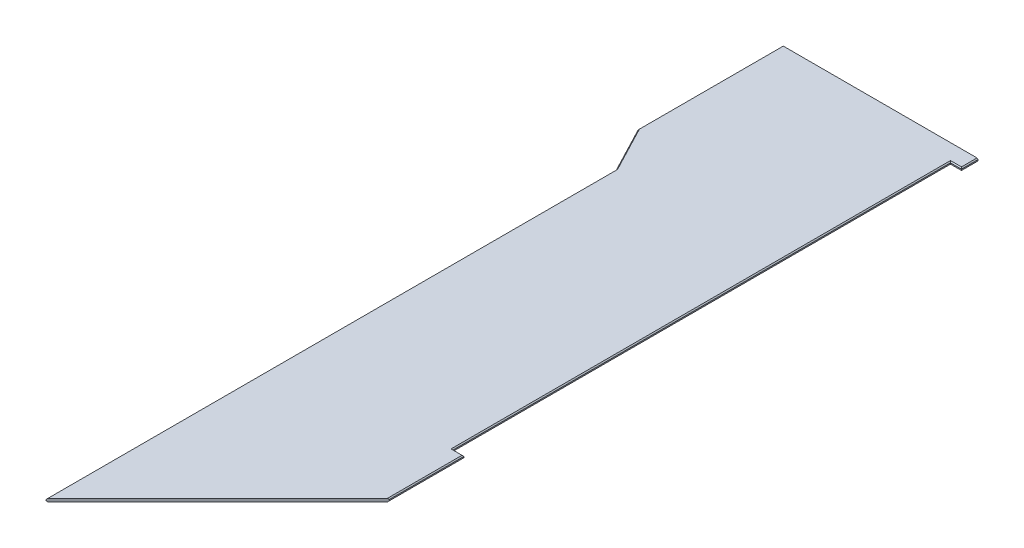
ISO-10303-21;
HEADER;
FILE_DESCRIPTION(('STEP AP214'),'2;1');
FILE_NAME('part.step','',(''),(''),'','','');
FILE_SCHEMA(('AUTOMOTIVE_DESIGN { 1 0 10303 214 1 1 1 1 }'));
ENDSEC;
DATA;
#1=APPLICATION_CONTEXT('core data for automotive mechanical design processes');
#2=APPLICATION_PROTOCOL_DEFINITION('international standard','automotive_design',2000,#1);
#3=PRODUCT_CONTEXT('',#1,'mechanical');
#4=PRODUCT('Part','Part','',(#3));
#5=PRODUCT_RELATED_PRODUCT_CATEGORY('part','',(#4));
#6=PRODUCT_DEFINITION_FORMATION('','',#4);
#7=PRODUCT_DEFINITION_CONTEXT('part definition',#1,'design');
#8=PRODUCT_DEFINITION('design','',#6,#7);
#9=PRODUCT_DEFINITION_SHAPE('','',#8);
#10=(LENGTH_UNIT() NAMED_UNIT(*) SI_UNIT(.MILLI.,.METRE.));
#11=(NAMED_UNIT(*) PLANE_ANGLE_UNIT() SI_UNIT($,.RADIAN.));
#12=(NAMED_UNIT(*) SI_UNIT($,.STERADIAN.) SOLID_ANGLE_UNIT());
#13=UNCERTAINTY_MEASURE_WITH_UNIT(LENGTH_MEASURE(1.E-05),#10,'distance_accuracy_value','');
#14=(GEOMETRIC_REPRESENTATION_CONTEXT(3) GLOBAL_UNCERTAINTY_ASSIGNED_CONTEXT((#13)) GLOBAL_UNIT_ASSIGNED_CONTEXT((#10,
#11,#12)) REPRESENTATION_CONTEXT('',''));
#15=CARTESIAN_POINT('',(0.,0.,0.));
#16=DIRECTION('',(0.,0.,1.));
#17=DIRECTION('',(1.,0.,0.));
#18=AXIS2_PLACEMENT_3D('',#15,#16,#17);
#19=CARTESIAN_POINT('',(552.551731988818,9.525,994.453846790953));
#20=DIRECTION('',(0.,0.,1.));
#21=DIRECTION('',(1.,0.,0.));
#22=AXIS2_PLACEMENT_3D('',#19,#20,#21);
#23=PLANE('',#22);
#24=DIRECTION('',(0.,-1.,0.));
#25=VECTOR('',#24,1.);
#26=CARTESIAN_POINT('',(552.551731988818,9.525,994.453846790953));
#27=LINE('',#26,#25);
#28=CARTESIAN_POINT('',(552.551731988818,3.52500000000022,994.453846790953));
#29=VERTEX_POINT('',#28);
#30=CARTESIAN_POINT('',(552.551731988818,-3.52500000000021,994.453846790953));
#31=VERTEX_POINT('',#30);
#32=EDGE_CURVE('E391',#29,#31,#27,.T.);
#33=ORIENTED_EDGE('',*,*,#32,.T.);
#34=DIRECTION('',(-1.,0.,0.));
#35=VECTOR('',#34,1.);
#36=CARTESIAN_POINT('',(486.051731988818,-3.52500000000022,994.453846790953));
#37=LINE('',#36,#35);
#38=CARTESIAN_POINT('',(486.051731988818,-3.52500000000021,994.453846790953));
#39=VERTEX_POINT('',#38);
#40=EDGE_CURVE('E327',#31,#39,#37,.T.);
#41=ORIENTED_EDGE('',*,*,#40,.T.);
#42=DIRECTION('',(0.,-1.,0.));
#43=VECTOR('',#42,1.);
#44=CARTESIAN_POINT('',(486.051731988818,9.525,994.453846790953));
#45=LINE('',#44,#43);
#46=CARTESIAN_POINT('',(486.051731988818,3.52500000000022,994.453846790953));
#47=VERTEX_POINT('',#46);
#48=EDGE_CURVE('E218',#47,#39,#45,.T.);
#49=ORIENTED_EDGE('',*,*,#48,.F.);
#50=DIRECTION('',(1.,0.,0.));
#51=VECTOR('',#50,1.);
#52=CARTESIAN_POINT('',(552.551731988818,3.52500000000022,994.453846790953));
#53=LINE('',#52,#51);
#54=EDGE_CURVE('E72',#47,#29,#53,.T.);
#55=ORIENTED_EDGE('',*,*,#54,.T.);
#56=EDGE_LOOP('',(#33,#41,#49,#55));
#57=FACE_BOUND('',#56,.T.);
#58=ADVANCED_FACE('F50',(#57),#23,.F.);
#59=CARTESIAN_POINT('',(486.051731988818,9.525,994.453846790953));
#60=DIRECTION('',(-1.,0.,0.));
#61=DIRECTION('',(0.,0.,1.));
#62=AXIS2_PLACEMENT_3D('',#59,#60,#61);
#63=PLANE('',#62);
#64=ORIENTED_EDGE('',*,*,#48,.T.);
#65=DIRECTION('',(0.,0.,-1.));
#66=VECTOR('',#65,1.);
#67=CARTESIAN_POINT('',(486.051731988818,-3.52500000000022,-2017.54615320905));
#68=LINE('',#67,#66);
#69=CARTESIAN_POINT('',(486.051731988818,-3.52500000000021,-2017.54615320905));
#70=VERTEX_POINT('',#69);
#71=EDGE_CURVE('E323',#39,#70,#68,.T.);
#72=ORIENTED_EDGE('',*,*,#71,.T.);
#73=DIRECTION('',(0.,-1.,0.));
#74=VECTOR('',#73,1.);
#75=CARTESIAN_POINT('',(486.051731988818,9.525,-2017.54615320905));
#76=LINE('',#75,#74);
#77=CARTESIAN_POINT('',(486.051731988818,3.52500000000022,-2017.54615320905));
#78=VERTEX_POINT('',#77);
#79=EDGE_CURVE('E228',#78,#70,#76,.T.);
#80=ORIENTED_EDGE('',*,*,#79,.F.);
#81=DIRECTION('',(0.,0.,1.));
#82=VECTOR('',#81,1.);
#83=CARTESIAN_POINT('',(486.051731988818,3.52500000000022,994.453846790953));
#84=LINE('',#83,#82);
#85=EDGE_CURVE('E325',#78,#47,#84,.T.);
#86=ORIENTED_EDGE('',*,*,#85,.T.);
#87=EDGE_LOOP('',(#64,#72,#80,#86));
#88=FACE_BOUND('',#87,.T.);
#89=ADVANCED_FACE('F464',(#88),#63,.F.);
#90=CARTESIAN_POINT('',(486.051731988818,9.525,-2017.54615320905));
#91=DIRECTION('',(0.,0.,-1.));
#92=DIRECTION('',(-1.,0.,0.));
#93=AXIS2_PLACEMENT_3D('',#90,#91,#92);
#94=PLANE('',#93);
#95=ORIENTED_EDGE('',*,*,#79,.T.);
#96=DIRECTION('',(1.,0.,0.));
#97=VECTOR('',#96,1.);
#98=CARTESIAN_POINT('',(552.551731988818,-3.52500000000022,-2017.54615320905));
#99=LINE('',#98,#97);
#100=CARTESIAN_POINT('',(552.551731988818,-3.52500000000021,-2017.54615320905));
#101=VERTEX_POINT('',#100);
#102=EDGE_CURVE('E316',#70,#101,#99,.T.);
#103=ORIENTED_EDGE('',*,*,#102,.T.);
#104=DIRECTION('',(0.,-1.,0.));
#105=VECTOR('',#104,1.);
#106=CARTESIAN_POINT('',(552.551731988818,9.525,-2017.54615320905));
#107=LINE('',#106,#105);
#108=CARTESIAN_POINT('',(552.551731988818,3.52500000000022,-2017.54615320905));
#109=VERTEX_POINT('',#108);
#110=EDGE_CURVE('E412',#109,#101,#107,.T.);
#111=ORIENTED_EDGE('',*,*,#110,.F.);
#112=DIRECTION('',(-1.,0.,0.));
#113=VECTOR('',#112,1.);
#114=CARTESIAN_POINT('',(486.051731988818,3.52500000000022,-2017.54615320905));
#115=LINE('',#114,#113);
#116=EDGE_CURVE('E317',#109,#78,#115,.T.);
#117=ORIENTED_EDGE('',*,*,#116,.T.);
#118=EDGE_LOOP('',(#95,#103,#111,#117));
#119=FACE_BOUND('',#118,.T.);
#120=ADVANCED_FACE('F421',(#119),#94,.F.);
#121=CARTESIAN_POINT('',(552.551731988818,9.525,-2017.54615320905));
#122=DIRECTION('',(-1.,0.,0.));
#123=DIRECTION('',(0.,0.,1.));
#124=AXIS2_PLACEMENT_3D('',#121,#122,#123);
#125=PLANE('',#124);
#126=ORIENTED_EDGE('',*,*,#110,.T.);
#127=DIRECTION('',(0.,0.,-1.));
#128=VECTOR('',#127,1.);
#129=CARTESIAN_POINT('',(552.551731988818,-3.52500000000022,-2117.54615320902));
#130=LINE('',#129,#128);
#131=CARTESIAN_POINT('',(552.551731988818,-3.52500000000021,-2117.54615320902));
#132=VERTEX_POINT('',#131);
#133=EDGE_CURVE('E315',#101,#132,#130,.T.);
#134=ORIENTED_EDGE('',*,*,#133,.T.);
#135=DIRECTION('',(0.,-1.,0.));
#136=VECTOR('',#135,1.);
#137=CARTESIAN_POINT('',(552.551731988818,9.525,-2117.54615320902));
#138=LINE('',#137,#136);
#139=CARTESIAN_POINT('',(552.551731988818,3.52500000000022,-2117.54615320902));
#140=VERTEX_POINT('',#139);
#141=EDGE_CURVE('E414',#140,#132,#138,.T.);
#142=ORIENTED_EDGE('',*,*,#141,.F.);
#143=DIRECTION('',(0.,0.,1.));
#144=VECTOR('',#143,1.);
#145=CARTESIAN_POINT('',(552.551731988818,3.52500000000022,-2017.54615320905));
#146=LINE('',#145,#144);
#147=EDGE_CURVE('E307',#140,#109,#146,.T.);
#148=ORIENTED_EDGE('',*,*,#147,.T.);
#149=EDGE_LOOP('',(#126,#134,#142,#148));
#150=FACE_BOUND('',#149,.T.);
#151=ADVANCED_FACE('F445',(#150),#125,.F.);
#152=CARTESIAN_POINT('',(552.551731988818,9.525,-2117.54615320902));
#153=DIRECTION('',(0.,0.,1.));
#154=DIRECTION('',(1.,0.,0.));
#155=AXIS2_PLACEMENT_3D('',#152,#153,#154);
#156=PLANE('',#155);
#157=DIRECTION('',(-1.,0.,0.));
#158=VECTOR('',#157,1.);
#159=CARTESIAN_POINT('',(552.551731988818,-9.525,-2117.54615320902));
#160=LINE('',#159,#158);
#161=CARTESIAN_POINT('',(546.551731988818,-9.525,-2117.54615320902));
#162=VERTEX_POINT('',#161);
#163=CARTESIAN_POINT('',(-626.248268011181,-9.525,-2117.54615320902));
#164=VERTEX_POINT('',#163);
#165=EDGE_CURVE('E341',#162,#164,#160,.T.);
#166=ORIENTED_EDGE('',*,*,#165,.T.);
#167=DIRECTION('',(-0.707106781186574,0.707106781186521,0.));
#168=VECTOR('',#167,1.);
#169=CARTESIAN_POINT('',(-632.248268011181,-3.52500000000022,-2117.54615320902));
#170=LINE('',#169,#168);
#171=CARTESIAN_POINT('',(-632.248268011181,-3.52500000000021,-2117.54615320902));
#172=VERTEX_POINT('',#171);
#173=EDGE_CURVE('E284',#164,#172,#170,.T.);
#174=ORIENTED_EDGE('',*,*,#173,.T.);
#175=DIRECTION('',(0.,-1.,0.));
#176=VECTOR('',#175,1.);
#177=CARTESIAN_POINT('',(-632.248268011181,9.525,-2117.54615320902));
#178=LINE('',#177,#176);
#179=CARTESIAN_POINT('',(-632.248268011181,3.52500000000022,-2117.54615320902));
#180=VERTEX_POINT('',#179);
#181=EDGE_CURVE('E410',#180,#172,#178,.T.);
#182=ORIENTED_EDGE('',*,*,#181,.F.);
#183=DIRECTION('',(-0.707106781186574,-0.707106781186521,0.));
#184=VECTOR('',#183,1.);
#185=CARTESIAN_POINT('',(-626.248268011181,9.525,-2117.54615320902));
#186=LINE('',#185,#184);
#187=CARTESIAN_POINT('',(-626.248268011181,9.525,-2117.54615320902));
#188=VERTEX_POINT('',#187);
#189=EDGE_CURVE('E279',#180,#188,#186,.F.);
#190=ORIENTED_EDGE('',*,*,#189,.T.);
#191=DIRECTION('',(-1.,0.,0.));
#192=VECTOR('',#191,1.);
#193=CARTESIAN_POINT('',(552.551731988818,9.525,-2117.54615320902));
#194=LINE('',#193,#192);
#195=CARTESIAN_POINT('',(546.551731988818,9.525,-2117.54615320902));
#196=VERTEX_POINT('',#195);
#197=EDGE_CURVE('E448',#196,#188,#194,.T.);
#198=ORIENTED_EDGE('',*,*,#197,.F.);
#199=DIRECTION('',(-0.707106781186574,0.707106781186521,0.));
#200=VECTOR('',#199,1.);
#201=CARTESIAN_POINT('',(546.551731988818,9.525,-2117.54615320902));
#202=LINE('',#201,#200);
#203=EDGE_CURVE('E275',#196,#140,#202,.F.);
#204=ORIENTED_EDGE('',*,*,#203,.T.);
#205=ORIENTED_EDGE('',*,*,#141,.T.);
#206=DIRECTION('',(-0.707106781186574,-0.707106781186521,0.));
#207=VECTOR('',#206,1.);
#208=CARTESIAN_POINT('',(552.551731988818,-3.52500000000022,-2117.54615320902));
#209=LINE('',#208,#207);
#210=EDGE_CURVE('E273',#132,#162,#209,.T.);
#211=ORIENTED_EDGE('',*,*,#210,.T.);
#212=EDGE_LOOP('',(#166,#174,#182,#190,#198,#204,#205,#211));
#213=FACE_BOUND('',#212,.T.);
#214=ADVANCED_FACE('F447',(#213),#156,.F.);
#215=CARTESIAN_POINT('',(-632.248268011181,9.525,-2117.54615320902));
#216=DIRECTION('',(1.,0.,0.));
#217=DIRECTION('',(0.,0.,-1.));
#218=AXIS2_PLACEMENT_3D('',#215,#216,#217);
#219=PLANE('',#218);
#220=ORIENTED_EDGE('',*,*,#181,.T.);
#221=DIRECTION('',(0.,0.,1.));
#222=VECTOR('',#221,1.);
#223=CARTESIAN_POINT('',(-632.248268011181,-3.52500000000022,-1245.01955496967));
#224=LINE('',#223,#222);
#225=CARTESIAN_POINT('',(-632.248268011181,-3.52500000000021,-1245.01955496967));
#226=VERTEX_POINT('',#225);
#227=EDGE_CURVE('E266',#172,#226,#224,.T.);
#228=ORIENTED_EDGE('',*,*,#227,.T.);
#229=DIRECTION('',(0.,-1.,0.));
#230=VECTOR('',#229,1.);
#231=CARTESIAN_POINT('',(-632.248268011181,9.525,-1245.01955496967));
#232=LINE('',#231,#230);
#233=CARTESIAN_POINT('',(-632.248268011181,3.52500000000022,-1245.01955496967));
#234=VERTEX_POINT('',#233);
#235=EDGE_CURVE('E401',#234,#226,#232,.T.);
#236=ORIENTED_EDGE('',*,*,#235,.F.);
#237=DIRECTION('',(0.,0.,-1.));
#238=VECTOR('',#237,1.);
#239=CARTESIAN_POINT('',(-632.248268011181,3.52500000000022,-2117.54615320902));
#240=LINE('',#239,#238);
#241=EDGE_CURVE('E267',#234,#180,#240,.T.);
#242=ORIENTED_EDGE('',*,*,#241,.T.);
#243=EDGE_LOOP('',(#220,#228,#236,#242));
#244=FACE_BOUND('',#243,.T.);
#245=ADVANCED_FACE('F690',(#244),#219,.F.);
#246=CARTESIAN_POINT('',(-487.06076801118,9.525,-967.229254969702));
#247=DIRECTION('',(0.886253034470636,0.,-0.463201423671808));
#248=DIRECTION('',(-0.463201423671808,0.,-0.886253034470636));
#249=AXIS2_PLACEMENT_3D('',#246,#247,#248);
#250=PLANE('',#249);
#251=ORIENTED_EDGE('',*,*,#235,.T.);
#252=DIRECTION('',(0.463201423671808,0.,0.886253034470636));
#253=VECTOR('',#252,1.);
#254=CARTESIAN_POINT('',(-487.06076801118,-3.52500000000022,-967.229254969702));
#255=LINE('',#254,#253);
#256=CARTESIAN_POINT('',(-487.06076801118,-3.52500000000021,-967.229254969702));
#257=VERTEX_POINT('',#256);
#258=EDGE_CURVE('E265',#226,#257,#255,.T.);
#259=ORIENTED_EDGE('',*,*,#258,.T.);
#260=DIRECTION('',(0.,-1.,0.));
#261=VECTOR('',#260,1.);
#262=CARTESIAN_POINT('',(-487.06076801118,9.525,-967.229254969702));
#263=LINE('',#262,#261);
#264=CARTESIAN_POINT('',(-487.06076801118,3.52500000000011,-967.229254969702));
#265=VERTEX_POINT('',#264);
#266=EDGE_CURVE('E212',#265,#257,#263,.T.);
#267=ORIENTED_EDGE('',*,*,#266,.F.);
#268=DIRECTION('',(-0.463201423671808,0.,-0.886253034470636));
#269=VECTOR('',#268,1.);
#270=CARTESIAN_POINT('',(-487.06076801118,3.52500000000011,-967.229254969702));
#271=LINE('',#270,#269);
#272=EDGE_CURVE('E258',#265,#234,#271,.T.);
#273=ORIENTED_EDGE('',*,*,#272,.T.);
#274=EDGE_LOOP('',(#251,#259,#267,#273));
#275=FACE_BOUND('',#274,.T.);
#276=ADVANCED_FACE('F676',(#275),#250,.F.);
#277=CARTESIAN_POINT('',(-487.06076801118,9.525,2485.26634679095));
#278=DIRECTION('',(1.,0.,0.));
#279=DIRECTION('',(0.,0.,-1.));
#280=AXIS2_PLACEMENT_3D('',#277,#278,#279);
#281=PLANE('',#280);
#282=ORIENTED_EDGE('',*,*,#266,.T.);
#283=DIRECTION('',(0.,0.,1.));
#284=VECTOR('',#283,1.);
#285=CARTESIAN_POINT('',(-487.06076801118,-3.52500000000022,2485.26634679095));
#286=LINE('',#285,#284);
#287=CARTESIAN_POINT('',(-487.06076801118,-3.52500000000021,2485.26634679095));
#288=VERTEX_POINT('',#287);
#289=EDGE_CURVE('E209',#257,#288,#286,.T.);
#290=ORIENTED_EDGE('',*,*,#289,.T.);
#291=DIRECTION('',(0.,-1.,0.));
#292=VECTOR('',#291,1.);
#293=CARTESIAN_POINT('',(-487.06076801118,9.525,2485.26634679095));
#294=LINE('',#293,#292);
#295=CARTESIAN_POINT('',(-487.06076801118,3.52500000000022,2485.26634679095));
#296=VERTEX_POINT('',#295);
#297=EDGE_CURVE('E192',#296,#288,#294,.T.);
#298=ORIENTED_EDGE('',*,*,#297,.F.);
#299=DIRECTION('',(0.,0.,-1.));
#300=VECTOR('',#299,1.);
#301=CARTESIAN_POINT('',(-487.06076801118,3.52500000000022,2485.26634679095));
#302=LINE('',#301,#300);
#303=EDGE_CURVE('E207',#296,#265,#302,.T.);
#304=ORIENTED_EDGE('',*,*,#303,.T.);
#305=EDGE_LOOP('',(#282,#290,#298,#304));
#306=FACE_BOUND('',#305,.T.);
#307=ADVANCED_FACE('F203',(#306),#281,.F.);
#308=CARTESIAN_POINT('',(552.551731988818,9.525,1445.65384679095));
#309=DIRECTION('',(-0.707106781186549,0.,-0.707106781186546));
#310=DIRECTION('',(-0.707106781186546,0.,0.707106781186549));
#311=AXIS2_PLACEMENT_3D('',#308,#309,#310);
#312=PLANE('',#311);
#313=ORIENTED_EDGE('',*,*,#297,.T.);
#314=DIRECTION('',(0.577350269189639,-0.577350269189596,-0.577350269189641));
#315=VECTOR('',#314,1.);
#316=CARTESIAN_POINT('',(-487.060768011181,-3.52500000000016,2485.26634679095));
#317=LINE('',#316,#315);
#318=CARTESIAN_POINT('',(-481.06076801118,-9.525,2479.26634679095));
#319=VERTEX_POINT('',#318);
#320=EDGE_CURVE('E198',#288,#319,#317,.T.);
#321=ORIENTED_EDGE('',*,*,#320,.T.);
#322=DIRECTION('',(0.707106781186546,0.,-0.707106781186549));
#323=VECTOR('',#322,1.);
#324=CARTESIAN_POINT('',(552.551731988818,-9.525,1445.65384679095));
#325=LINE('',#324,#323);
#326=CARTESIAN_POINT('',(546.551731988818,-9.525,1451.65384679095));
#327=VERTEX_POINT('',#326);
#328=EDGE_CURVE('E765',#319,#327,#325,.T.);
#329=ORIENTED_EDGE('',*,*,#328,.T.);
#330=DIRECTION('',(0.577350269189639,0.577350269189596,-0.577350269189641));
#331=VECTOR('',#330,1.);
#332=CARTESIAN_POINT('',(552.551731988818,-3.52500000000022,1445.65384679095));
#333=LINE('',#332,#331);
#334=CARTESIAN_POINT('',(552.551731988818,-3.52500000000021,1445.65384679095));
#335=VERTEX_POINT('',#334);
#336=EDGE_CURVE('E197',#327,#335,#333,.T.);
#337=ORIENTED_EDGE('',*,*,#336,.T.);
#338=DIRECTION('',(0.,-1.,0.));
#339=VECTOR('',#338,1.);
#340=CARTESIAN_POINT('',(552.551731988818,9.525,1445.65384679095));
#341=LINE('',#340,#339);
#342=CARTESIAN_POINT('',(552.551731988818,3.52500000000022,1445.65384679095));
#343=VERTEX_POINT('',#342);
#344=EDGE_CURVE('E215',#343,#335,#341,.T.);
#345=ORIENTED_EDGE('',*,*,#344,.F.);
#346=DIRECTION('',(0.577350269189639,-0.577350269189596,-0.577350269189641));
#347=VECTOR('',#346,1.);
#348=CARTESIAN_POINT('',(1030.43634758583,-474.359615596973,967.769231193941));
#349=LINE('',#348,#347);
#350=CARTESIAN_POINT('',(546.551731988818,9.525,1451.65384679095));
#351=VERTEX_POINT('',#350);
#352=EDGE_CURVE('E224',#343,#351,#349,.F.);
#353=ORIENTED_EDGE('',*,*,#352,.T.);
#354=DIRECTION('',(0.707106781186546,0.,-0.707106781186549));
#355=VECTOR('',#354,1.);
#356=CARTESIAN_POINT('',(552.551731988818,9.525,1445.65384679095));
#357=LINE('',#356,#355);
#358=CARTESIAN_POINT('',(-481.06076801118,9.525,2479.26634679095));
#359=VERTEX_POINT('',#358);
#360=EDGE_CURVE('E194',#359,#351,#357,.T.);
#361=ORIENTED_EDGE('',*,*,#360,.F.);
#362=DIRECTION('',(0.577350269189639,0.577350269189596,-0.577350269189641));
#363=VECTOR('',#362,1.);
#364=CARTESIAN_POINT('',(345.361347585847,835.947115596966,1652.84423119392));
#365=LINE('',#364,#363);
#366=EDGE_CURVE('E189',#359,#296,#365,.F.);
#367=ORIENTED_EDGE('',*,*,#366,.T.);
#368=EDGE_LOOP('',(#313,#321,#329,#337,#345,#353,#361,#367));
#369=FACE_BOUND('',#368,.T.);
#370=ADVANCED_FACE('F188',(#369),#312,.F.);
#371=CARTESIAN_POINT('',(552.551731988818,9.525,1445.65384679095));
#372=DIRECTION('',(-1.,0.,0.));
#373=DIRECTION('',(0.,0.,1.));
#374=AXIS2_PLACEMENT_3D('',#371,#372,#373);
#375=PLANE('',#374);
#376=ORIENTED_EDGE('',*,*,#344,.T.);
#377=DIRECTION('',(0.,0.,-1.));
#378=VECTOR('',#377,1.);
#379=CARTESIAN_POINT('',(552.551731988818,-3.52500000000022,994.453846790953));
#380=LINE('',#379,#378);
#381=EDGE_CURVE('E11',#335,#31,#380,.T.);
#382=ORIENTED_EDGE('',*,*,#381,.T.);
#383=ORIENTED_EDGE('',*,*,#32,.F.);
#384=DIRECTION('',(0.,0.,1.));
#385=VECTOR('',#384,1.);
#386=CARTESIAN_POINT('',(552.551731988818,3.52500000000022,1445.65384679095));
#387=LINE('',#386,#385);
#388=EDGE_CURVE('E59',#29,#343,#387,.T.);
#389=ORIENTED_EDGE('',*,*,#388,.T.);
#390=EDGE_LOOP('',(#376,#382,#383,#389));
#391=FACE_BOUND('',#390,.T.);
#392=ADVANCED_FACE('F394',(#391),#375,.F.);
#393=CARTESIAN_POINT('',(0.,9.525,0.));
#394=DIRECTION('',(0.,-1.,0.));
#395=DIRECTION('',(0.,0.,-1.));
#396=AXIS2_PLACEMENT_3D('',#393,#394,#395);
#397=PLANE('',#396);
#398=DIRECTION('',(0.463201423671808,0.,0.886253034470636));
#399=VECTOR('',#398,1.);
#400=CARTESIAN_POINT('',(19.8191740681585,9.525,-10.3585198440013));
#401=LINE('',#400,#399);
#402=CARTESIAN_POINT('',(-626.248268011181,9.525,-1246.49295673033));
#403=VERTEX_POINT('',#402);
#404=CARTESIAN_POINT('',(-481.06076801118,9.525,-968.702656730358));
#405=VERTEX_POINT('',#404);
#406=EDGE_CURVE('E303',#403,#405,#401,.T.);
#407=ORIENTED_EDGE('',*,*,#406,.T.);
#408=DIRECTION('',(0.,0.,1.));
#409=VECTOR('',#408,1.);
#410=CARTESIAN_POINT('',(-481.06076801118,9.525,0.));
#411=LINE('',#410,#409);
#412=EDGE_CURVE('E306',#405,#359,#411,.T.);
#413=ORIENTED_EDGE('',*,*,#412,.T.);
#414=ORIENTED_EDGE('',*,*,#360,.T.);
#415=DIRECTION('',(0.,0.,-1.));
#416=VECTOR('',#415,1.);
#417=CARTESIAN_POINT('',(546.551731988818,9.525,0.));
#418=LINE('',#417,#416);
#419=CARTESIAN_POINT('',(546.551731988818,9.525,1000.45384679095));
#420=VERTEX_POINT('',#419);
#421=EDGE_CURVE('E283',#351,#420,#418,.T.);
#422=ORIENTED_EDGE('',*,*,#421,.T.);
#423=DIRECTION('',(-1.,0.,0.));
#424=VECTOR('',#423,1.);
#425=CARTESIAN_POINT('',(0.,9.525,1000.45384679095));
#426=LINE('',#425,#424);
#427=CARTESIAN_POINT('',(480.051731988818,9.525,1000.45384679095));
#428=VERTEX_POINT('',#427);
#429=EDGE_CURVE('E290',#420,#428,#426,.T.);
#430=ORIENTED_EDGE('',*,*,#429,.T.);
#431=DIRECTION('',(0.,0.,-1.));
#432=VECTOR('',#431,1.);
#433=CARTESIAN_POINT('',(480.051731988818,9.525,0.));
#434=LINE('',#433,#432);
#435=CARTESIAN_POINT('',(480.051731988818,9.525,-2023.54615320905));
#436=VERTEX_POINT('',#435);
#437=EDGE_CURVE('E288',#428,#436,#434,.T.);
#438=ORIENTED_EDGE('',*,*,#437,.T.);
#439=DIRECTION('',(1.,0.,0.));
#440=VECTOR('',#439,1.);
#441=CARTESIAN_POINT('',(0.,9.525,-2023.54615320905));
#442=LINE('',#441,#440);
#443=CARTESIAN_POINT('',(546.551731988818,9.525,-2023.54615320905));
#444=VERTEX_POINT('',#443);
#445=EDGE_CURVE('E291',#436,#444,#442,.T.);
#446=ORIENTED_EDGE('',*,*,#445,.T.);
#447=DIRECTION('',(0.,0.,-1.));
#448=VECTOR('',#447,1.);
#449=CARTESIAN_POINT('',(546.551731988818,9.525,0.));
#450=LINE('',#449,#448);
#451=EDGE_CURVE('E298',#444,#196,#450,.T.);
#452=ORIENTED_EDGE('',*,*,#451,.T.);
#453=ORIENTED_EDGE('',*,*,#197,.T.);
#454=DIRECTION('',(0.,0.,1.));
#455=VECTOR('',#454,1.);
#456=CARTESIAN_POINT('',(-626.248268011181,9.525,0.));
#457=LINE('',#456,#455);
#458=EDGE_CURVE('E297',#188,#403,#457,.T.);
#459=ORIENTED_EDGE('',*,*,#458,.T.);
#460=EDGE_LOOP('',(#407,#413,#414,#422,#430,#438,#446,#452,#453,#459));
#461=FACE_BOUND('',#460,.T.);
#462=ADVANCED_FACE('F453',(#461),#397,.F.);
#463=CARTESIAN_POINT('',(0.,-9.525,0.));
#464=DIRECTION('',(0.,-1.,0.));
#465=DIRECTION('',(0.,0.,-1.));
#466=AXIS2_PLACEMENT_3D('',#463,#464,#465);
#467=PLANE('',#466);
#468=ORIENTED_EDGE('',*,*,#328,.F.);
#469=DIRECTION('',(0.,0.,-1.));
#470=VECTOR('',#469,1.);
#471=CARTESIAN_POINT('',(-481.06076801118,-9.525,-967.229254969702));
#472=LINE('',#471,#470);
#473=CARTESIAN_POINT('',(-481.06076801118,-9.525,-968.702656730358));
#474=VERTEX_POINT('',#473);
#475=EDGE_CURVE('E260',#319,#474,#472,.T.);
#476=ORIENTED_EDGE('',*,*,#475,.T.);
#477=DIRECTION('',(-0.463201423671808,0.,-0.886253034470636));
#478=VECTOR('',#477,1.);
#479=CARTESIAN_POINT('',(-626.930749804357,-9.525,-1247.79876351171));
#480=LINE('',#479,#478);
#481=CARTESIAN_POINT('',(-626.248268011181,-9.525,-1246.49295673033));
#482=VERTEX_POINT('',#481);
#483=EDGE_CURVE('E251',#474,#482,#480,.T.);
#484=ORIENTED_EDGE('',*,*,#483,.T.);
#485=DIRECTION('',(0.,0.,-1.));
#486=VECTOR('',#485,1.);
#487=CARTESIAN_POINT('',(-626.248268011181,-9.525,-2117.54615320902));
#488=LINE('',#487,#486);
#489=EDGE_CURVE('E252',#482,#164,#488,.T.);
#490=ORIENTED_EDGE('',*,*,#489,.T.);
#491=ORIENTED_EDGE('',*,*,#165,.F.);
#492=DIRECTION('',(0.,0.,1.));
#493=VECTOR('',#492,1.);
#494=CARTESIAN_POINT('',(546.551731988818,-9.525,-2017.54615320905));
#495=LINE('',#494,#493);
#496=CARTESIAN_POINT('',(546.551731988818,-9.525,-2023.54615320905));
#497=VERTEX_POINT('',#496);
#498=EDGE_CURVE('E247',#162,#497,#495,.T.);
#499=ORIENTED_EDGE('',*,*,#498,.T.);
#500=DIRECTION('',(-1.,0.,0.));
#501=VECTOR('',#500,1.);
#502=CARTESIAN_POINT('',(486.051731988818,-9.525,-2023.54615320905));
#503=LINE('',#502,#501);
#504=CARTESIAN_POINT('',(480.051731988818,-9.525,-2023.54615320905));
#505=VERTEX_POINT('',#504);
#506=EDGE_CURVE('E244',#497,#505,#503,.T.);
#507=ORIENTED_EDGE('',*,*,#506,.T.);
#508=DIRECTION('',(0.,0.,1.));
#509=VECTOR('',#508,1.);
#510=CARTESIAN_POINT('',(480.051731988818,-9.525,994.453846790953));
#511=LINE('',#510,#509);
#512=CARTESIAN_POINT('',(480.051731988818,-9.525,1000.45384679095));
#513=VERTEX_POINT('',#512);
#514=EDGE_CURVE('E245',#505,#513,#511,.T.);
#515=ORIENTED_EDGE('',*,*,#514,.T.);
#516=DIRECTION('',(1.,0.,0.));
#517=VECTOR('',#516,1.);
#518=CARTESIAN_POINT('',(552.551731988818,-9.525,1000.45384679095));
#519=LINE('',#518,#517);
#520=CARTESIAN_POINT('',(546.551731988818,-9.525,1000.45384679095));
#521=VERTEX_POINT('',#520);
#522=EDGE_CURVE('E237',#513,#521,#519,.T.);
#523=ORIENTED_EDGE('',*,*,#522,.T.);
#524=DIRECTION('',(0.,0.,1.));
#525=VECTOR('',#524,1.);
#526=CARTESIAN_POINT('',(546.551731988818,-9.525,1445.65384679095));
#527=LINE('',#526,#525);
#528=EDGE_CURVE('E236',#521,#327,#527,.T.);
#529=ORIENTED_EDGE('',*,*,#528,.T.);
#530=EDGE_LOOP('',(#468,#476,#484,#490,#491,#499,#507,#515,#523,#529));
#531=FACE_BOUND('',#530,.T.);
#532=ADVANCED_FACE('F474',(#531),#467,.T.);
#533=CARTESIAN_POINT('',(-632.248268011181,-3.52500000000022,-2117.54615320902));
#534=DIRECTION('',(-0.707106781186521,-0.707106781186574,0.));
#535=DIRECTION('',(0.,0.,-1.));
#536=AXIS2_PLACEMENT_3D('',#533,#534,#535);
#537=PLANE('',#536);
#538=ORIENTED_EDGE('',*,*,#173,.F.);
#539=ORIENTED_EDGE('',*,*,#489,.F.);
#540=DIRECTION('',(-0.696681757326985,0.696681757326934,0.17108202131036));
#541=VECTOR('',#540,1.);
#542=CARTESIAN_POINT('',(-528.252064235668,-107.521203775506,-1270.55758659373));
#543=LINE('',#542,#541);
#544=EDGE_CURVE('E339',#226,#482,#543,.F.);
#545=ORIENTED_EDGE('',*,*,#544,.F.);
#546=ORIENTED_EDGE('',*,*,#227,.F.);
#547=EDGE_LOOP('',(#538,#539,#545,#546));
#548=FACE_BOUND('',#547,.T.);
#549=ADVANCED_FACE('F512',(#548),#537,.T.);
#550=CARTESIAN_POINT('',(-487.06076801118,-3.52500000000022,-967.229254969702));
#551=DIRECTION('',(-0.626675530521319,-0.707106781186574,0.327532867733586));
#552=DIRECTION('',(-0.463201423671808,0.,-0.886253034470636));
#553=AXIS2_PLACEMENT_3D('',#550,#551,#552);
#554=PLANE('',#553);
#555=ORIENTED_EDGE('',*,*,#544,.T.);
#556=ORIENTED_EDGE('',*,*,#483,.F.);
#557=DIRECTION('',(-0.696681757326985,0.696681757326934,0.17108202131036));
#558=VECTOR('',#557,1.);
#559=CARTESIAN_POINT('',(-898.562763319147,407.976995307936,-866.177960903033));
#560=LINE('',#559,#558);
#561=EDGE_CURVE('E333',#257,#474,#560,.F.);
#562=ORIENTED_EDGE('',*,*,#561,.F.);
#563=ORIENTED_EDGE('',*,*,#258,.F.);
#564=EDGE_LOOP('',(#555,#556,#562,#563));
#565=FACE_BOUND('',#564,.T.);
#566=ADVANCED_FACE('F502',(#565),#554,.T.);
#567=CARTESIAN_POINT('',(-487.06076801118,-3.52500000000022,2485.26634679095));
#568=DIRECTION('',(-0.707106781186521,-0.707106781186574,0.));
#569=DIRECTION('',(0.,0.,-1.));
#570=AXIS2_PLACEMENT_3D('',#567,#568,#569);
#571=PLANE('',#570);
#572=ORIENTED_EDGE('',*,*,#561,.T.);
#573=ORIENTED_EDGE('',*,*,#475,.F.);
#574=ORIENTED_EDGE('',*,*,#320,.F.);
#575=ORIENTED_EDGE('',*,*,#289,.F.);
#576=EDGE_LOOP('',(#572,#573,#574,#575));
#577=FACE_BOUND('',#576,.T.);
#578=ADVANCED_FACE('F496',(#577),#571,.T.);
#579=CARTESIAN_POINT('',(-626.248268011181,9.525,0.));
#580=DIRECTION('',(0.707106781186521,-0.707106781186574,0.));
#581=DIRECTION('',(0.,0.,1.));
#582=AXIS2_PLACEMENT_3D('',#579,#580,#581);
#583=PLANE('',#582);
#584=ORIENTED_EDGE('',*,*,#189,.F.);
#585=ORIENTED_EDGE('',*,*,#241,.F.);
#586=DIRECTION('',(0.696681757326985,0.696681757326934,-0.17108202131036));
#587=VECTOR('',#586,1.);
#588=CARTESIAN_POINT('',(-774.817418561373,-139.044150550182,-1210.00928206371));
#589=LINE('',#588,#587);
#590=EDGE_CURVE('E338',#403,#234,#589,.F.);
#591=ORIENTED_EDGE('',*,*,#590,.F.);
#592=ORIENTED_EDGE('',*,*,#458,.F.);
#593=EDGE_LOOP('',(#584,#585,#591,#592));
#594=FACE_BOUND('',#593,.T.);
#595=ADVANCED_FACE('F503',(#594),#583,.F.);
#596=CARTESIAN_POINT('',(19.8191740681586,9.525,-10.3585198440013));
#597=DIRECTION('',(0.626675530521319,-0.707106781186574,-0.327532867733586));
#598=DIRECTION('',(0.463201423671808,0.,0.886253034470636));
#599=AXIS2_PLACEMENT_3D('',#596,#597,#598);
#600=PLANE('',#599);
#601=ORIENTED_EDGE('',*,*,#590,.T.);
#602=ORIENTED_EDGE('',*,*,#272,.F.);
#603=DIRECTION('',(0.696681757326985,0.696681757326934,-0.17108202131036));
#604=VECTOR('',#603,1.);
#605=CARTESIAN_POINT('',(-596.520169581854,-105.934401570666,-940.349642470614));
#606=LINE('',#605,#604);
#607=EDGE_CURVE('E216',#405,#265,#606,.F.);
#608=ORIENTED_EDGE('',*,*,#607,.F.);
#609=ORIENTED_EDGE('',*,*,#406,.F.);
#610=EDGE_LOOP('',(#601,#602,#608,#609));
#611=FACE_BOUND('',#610,.T.);
#612=ADVANCED_FACE('F484',(#611),#600,.F.);
#613=CARTESIAN_POINT('',(-481.06076801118,9.525,0.));
#614=DIRECTION('',(0.707106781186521,-0.707106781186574,0.));
#615=DIRECTION('',(0.,0.,1.));
#616=AXIS2_PLACEMENT_3D('',#613,#614,#615);
#617=PLANE('',#616);
#618=ORIENTED_EDGE('',*,*,#607,.T.);
#619=ORIENTED_EDGE('',*,*,#303,.F.);
#620=ORIENTED_EDGE('',*,*,#366,.F.);
#621=ORIENTED_EDGE('',*,*,#412,.F.);
#622=EDGE_LOOP('',(#618,#619,#620,#621));
#623=FACE_BOUND('',#622,.T.);
#624=ADVANCED_FACE('F213',(#623),#617,.F.);
#625=CARTESIAN_POINT('',(552.551731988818,-3.52500000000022,1445.65384679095));
#626=DIRECTION('',(0.707106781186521,-0.707106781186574,0.));
#627=DIRECTION('',(0.,0.,1.));
#628=AXIS2_PLACEMENT_3D('',#625,#626,#627);
#629=PLANE('',#628);
#630=ORIENTED_EDGE('',*,*,#336,.F.);
#631=ORIENTED_EDGE('',*,*,#528,.F.);
#632=DIRECTION('',(0.57735026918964,0.577350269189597,-0.57735026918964));
#633=VECTOR('',#632,1.);
#634=CARTESIAN_POINT('',(402.151731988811,-153.924999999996,1144.85384679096));
#635=LINE('',#634,#633);
#636=EDGE_CURVE('E346',#31,#521,#635,.F.);
#637=ORIENTED_EDGE('',*,*,#636,.F.);
#638=ORIENTED_EDGE('',*,*,#381,.F.);
#639=EDGE_LOOP('',(#630,#631,#637,#638));
#640=FACE_BOUND('',#639,.T.);
#641=ADVANCED_FACE('F473',(#640),#629,.T.);
#642=CARTESIAN_POINT('',(552.551731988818,-3.52500000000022,994.453846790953));
#643=DIRECTION('',(0.,-0.707106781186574,-0.707106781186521));
#644=DIRECTION('',(1.,0.,0.));
#645=AXIS2_PLACEMENT_3D('',#642,#643,#644);
#646=PLANE('',#645);
#647=ORIENTED_EDGE('',*,*,#636,.T.);
#648=ORIENTED_EDGE('',*,*,#522,.F.);
#649=DIRECTION('',(0.577350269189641,0.577350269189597,-0.577350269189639));
#650=VECTOR('',#649,1.);
#651=CARTESIAN_POINT('',(486.051731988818,-3.52500000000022,994.453846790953));
#652=LINE('',#651,#650);
#653=EDGE_CURVE('E360',#39,#513,#652,.F.);
#654=ORIENTED_EDGE('',*,*,#653,.F.);
#655=ORIENTED_EDGE('',*,*,#40,.F.);
#656=EDGE_LOOP('',(#647,#648,#654,#655));
#657=FACE_BOUND('',#656,.T.);
#658=ADVANCED_FACE('F466',(#657),#646,.T.);
#659=CARTESIAN_POINT('',(486.051731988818,-3.52500000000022,994.453846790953));
#660=DIRECTION('',(0.70710678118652,-0.707106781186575,0.));
#661=DIRECTION('',(0.,0.,1.));
#662=AXIS2_PLACEMENT_3D('',#659,#660,#661);
#663=PLANE('',#662);
#664=ORIENTED_EDGE('',*,*,#653,.T.);
#665=ORIENTED_EDGE('',*,*,#514,.F.);
#666=DIRECTION('',(0.577350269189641,0.577350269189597,0.577350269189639));
#667=VECTOR('',#666,1.);
#668=CARTESIAN_POINT('',(486.051731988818,-3.52500000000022,-2017.54615320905));
#669=LINE('',#668,#667);
#670=EDGE_CURVE('E353',#70,#505,#669,.F.);
#671=ORIENTED_EDGE('',*,*,#670,.F.);
#672=ORIENTED_EDGE('',*,*,#71,.F.);
#673=EDGE_LOOP('',(#664,#665,#671,#672));
#674=FACE_BOUND('',#673,.T.);
#675=ADVANCED_FACE('F431',(#674),#663,.T.);
#676=CARTESIAN_POINT('',(486.051731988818,-3.52500000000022,-2017.54615320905));
#677=DIRECTION('',(0.,-0.707106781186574,0.707106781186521));
#678=DIRECTION('',(-1.,0.,0.));
#679=AXIS2_PLACEMENT_3D('',#676,#677,#678);
#680=PLANE('',#679);
#681=ORIENTED_EDGE('',*,*,#670,.T.);
#682=ORIENTED_EDGE('',*,*,#506,.F.);
#683=DIRECTION('',(0.57735026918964,0.577350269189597,0.57735026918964));
#684=VECTOR('',#683,1.);
#685=CARTESIAN_POINT('',(530.38506532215,-25.6916666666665,-2039.71281987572));
#686=LINE('',#685,#684);
#687=EDGE_CURVE('E352',#101,#497,#686,.F.);
#688=ORIENTED_EDGE('',*,*,#687,.F.);
#689=ORIENTED_EDGE('',*,*,#102,.F.);
#690=EDGE_LOOP('',(#681,#682,#688,#689));
#691=FACE_BOUND('',#690,.T.);
#692=ADVANCED_FACE('F434',(#691),#680,.T.);
#693=CARTESIAN_POINT('',(552.551731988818,-3.52500000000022,-2017.54615320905));
#694=DIRECTION('',(0.707106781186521,-0.707106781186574,0.));
#695=DIRECTION('',(0.,0.,1.));
#696=AXIS2_PLACEMENT_3D('',#693,#694,#695);
#697=PLANE('',#696);
#698=ORIENTED_EDGE('',*,*,#687,.T.);
#699=ORIENTED_EDGE('',*,*,#498,.F.);
#700=ORIENTED_EDGE('',*,*,#210,.F.);
#701=ORIENTED_EDGE('',*,*,#133,.F.);
#702=EDGE_LOOP('',(#698,#699,#700,#701));
#703=FACE_BOUND('',#702,.T.);
#704=ADVANCED_FACE('F437',(#703),#697,.T.);
#705=CARTESIAN_POINT('',(546.551731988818,9.525,0.));
#706=DIRECTION('',(-0.707106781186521,-0.707106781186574,0.));
#707=DIRECTION('',(0.,0.,-1.));
#708=AXIS2_PLACEMENT_3D('',#705,#706,#707);
#709=PLANE('',#708);
#710=ORIENTED_EDGE('',*,*,#352,.F.);
#711=ORIENTED_EDGE('',*,*,#388,.F.);
#712=DIRECTION('',(-0.57735026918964,0.577350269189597,0.57735026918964));
#713=VECTOR('',#712,1.);
#714=CARTESIAN_POINT('',(880.036347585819,-323.959615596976,666.969231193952));
#715=LINE('',#714,#713);
#716=EDGE_CURVE('E55',#420,#29,#715,.F.);
#717=ORIENTED_EDGE('',*,*,#716,.F.);
#718=ORIENTED_EDGE('',*,*,#421,.F.);
#719=EDGE_LOOP('',(#710,#711,#717,#718));
#720=FACE_BOUND('',#719,.T.);
#721=ADVANCED_FACE('F49',(#720),#709,.F.);
#722=CARTESIAN_POINT('',(0.,9.525,1000.45384679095));
#723=DIRECTION('',(0.,-0.707106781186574,0.707106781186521));
#724=DIRECTION('',(-1.,0.,0.));
#725=AXIS2_PLACEMENT_3D('',#722,#723,#724);
#726=PLANE('',#725);
#727=ORIENTED_EDGE('',*,*,#716,.T.);
#728=ORIENTED_EDGE('',*,*,#54,.F.);
#729=DIRECTION('',(-0.577350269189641,0.577350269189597,0.577350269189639));
#730=VECTOR('',#729,1.);
#731=CARTESIAN_POINT('',(813.536347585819,-323.959615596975,666.969231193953));
#732=LINE('',#731,#730);
#733=EDGE_CURVE('E373',#428,#47,#732,.F.);
#734=ORIENTED_EDGE('',*,*,#733,.F.);
#735=ORIENTED_EDGE('',*,*,#429,.F.);
#736=EDGE_LOOP('',(#727,#728,#734,#735));
#737=FACE_BOUND('',#736,.T.);
#738=ADVANCED_FACE('F383',(#737),#726,.F.);
#739=CARTESIAN_POINT('',(480.051731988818,9.525,0.));
#740=DIRECTION('',(-0.70710678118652,-0.707106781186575,0.));
#741=DIRECTION('',(0.,0.,-1.));
#742=AXIS2_PLACEMENT_3D('',#739,#740,#741);
#743=PLANE('',#742);
#744=ORIENTED_EDGE('',*,*,#733,.T.);
#745=ORIENTED_EDGE('',*,*,#85,.F.);
#746=DIRECTION('',(-0.577350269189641,0.577350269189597,-0.577350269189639));
#747=VECTOR('',#746,1.);
#748=CARTESIAN_POINT('',(320.034487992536,169.542243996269,-2183.56339720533));
#749=LINE('',#748,#747);
#750=EDGE_CURVE('E369',#436,#78,#749,.F.);
#751=ORIENTED_EDGE('',*,*,#750,.F.);
#752=ORIENTED_EDGE('',*,*,#437,.F.);
#753=EDGE_LOOP('',(#744,#745,#751,#752));
#754=FACE_BOUND('',#753,.T.);
#755=ADVANCED_FACE('F465',(#754),#743,.F.);
#756=CARTESIAN_POINT('',(0.,9.525,-2023.54615320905));
#757=DIRECTION('',(0.,-0.707106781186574,-0.707106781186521));
#758=DIRECTION('',(1.,0.,0.));
#759=AXIS2_PLACEMENT_3D('',#756,#757,#758);
#760=PLANE('',#759);
#761=ORIENTED_EDGE('',*,*,#750,.T.);
#762=ORIENTED_EDGE('',*,*,#116,.F.);
#763=DIRECTION('',(-0.57735026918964,0.577350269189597,-0.57735026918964));
#764=VECTOR('',#763,1.);
#765=CARTESIAN_POINT('',(364.36782132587,191.708910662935,-2205.730063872));
#766=LINE('',#765,#764);
#767=EDGE_CURVE('E366',#444,#109,#766,.F.);
#768=ORIENTED_EDGE('',*,*,#767,.F.);
#769=ORIENTED_EDGE('',*,*,#445,.F.);
#770=EDGE_LOOP('',(#761,#762,#768,#769));
#771=FACE_BOUND('',#770,.T.);
#772=ADVANCED_FACE('F462',(#771),#760,.F.);
#773=CARTESIAN_POINT('',(546.551731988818,9.525,0.));
#774=DIRECTION('',(-0.707106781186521,-0.707106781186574,0.));
#775=DIRECTION('',(0.,0.,-1.));
#776=AXIS2_PLACEMENT_3D('',#773,#774,#775);
#777=PLANE('',#776);
#778=ORIENTED_EDGE('',*,*,#767,.T.);
#779=ORIENTED_EDGE('',*,*,#147,.F.);
#780=ORIENTED_EDGE('',*,*,#203,.F.);
#781=ORIENTED_EDGE('',*,*,#451,.F.);
#782=EDGE_LOOP('',(#778,#779,#780,#781));
#783=FACE_BOUND('',#782,.T.);
#784=ADVANCED_FACE('F454',(#783),#777,.F.);
#785=CLOSED_SHELL('',(#58,#89,#120,#151,#214,#245,#276,#307,#370,#392,#462,#532,#549,#566,#578,
#595,#612,#624,#641,#658,#675,#692,#704,#721,#738,#755,#772,#784));
#786=MANIFOLD_SOLID_BREP('B2',#785);
#787=ADVANCED_BREP_SHAPE_REPRESENTATION('',(#18,#786),#14);
#788=SHAPE_DEFINITION_REPRESENTATION(#9,#787);
ENDSEC;
END-ISO-10303-21;
